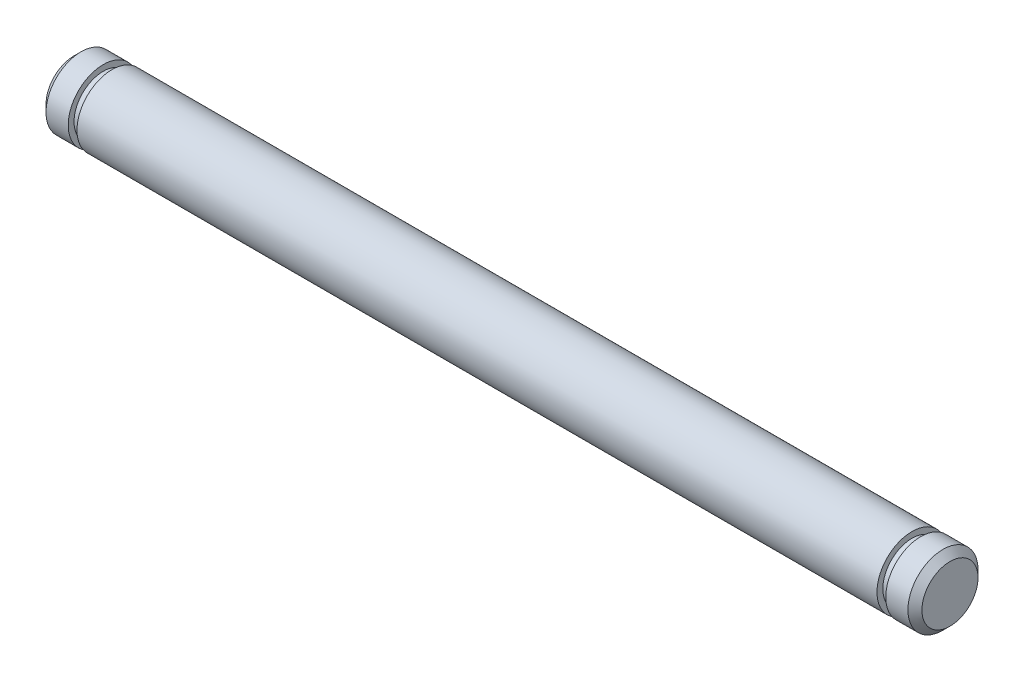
ISO-10303-21;
HEADER;
FILE_DESCRIPTION(('STEP AP214'),'2;1');
FILE_NAME('part.step','',(''),(''),'','','');
FILE_SCHEMA(('AUTOMOTIVE_DESIGN { 1 0 10303 214 1 1 1 1 }'));
ENDSEC;
DATA;
#1=APPLICATION_CONTEXT('core data for automotive mechanical design processes');
#2=APPLICATION_PROTOCOL_DEFINITION('international standard','automotive_design',2000,#1);
#3=PRODUCT_CONTEXT('',#1,'mechanical');
#4=PRODUCT('Part','Part','',(#3));
#5=PRODUCT_RELATED_PRODUCT_CATEGORY('part','',(#4));
#6=PRODUCT_DEFINITION_FORMATION('','',#4);
#7=PRODUCT_DEFINITION_CONTEXT('part definition',#1,'design');
#8=PRODUCT_DEFINITION('design','',#6,#7);
#9=PRODUCT_DEFINITION_SHAPE('','',#8);
#10=(LENGTH_UNIT() NAMED_UNIT(*) SI_UNIT(.MILLI.,.METRE.));
#11=(NAMED_UNIT(*) PLANE_ANGLE_UNIT() SI_UNIT($,.RADIAN.));
#12=(NAMED_UNIT(*) SI_UNIT($,.STERADIAN.) SOLID_ANGLE_UNIT());
#13=UNCERTAINTY_MEASURE_WITH_UNIT(LENGTH_MEASURE(1.E-05),#10,'distance_accuracy_value','');
#14=(GEOMETRIC_REPRESENTATION_CONTEXT(3) GLOBAL_UNCERTAINTY_ASSIGNED_CONTEXT((#13)) GLOBAL_UNIT_ASSIGNED_CONTEXT((#10,
#11,#12)) REPRESENTATION_CONTEXT('',''));
#15=CARTESIAN_POINT('',(0.,0.,0.));
#16=DIRECTION('',(0.,0.,1.));
#17=DIRECTION('',(1.,0.,0.));
#18=AXIS2_PLACEMENT_3D('',#15,#16,#17);
#19=CARTESIAN_POINT('',(37.5,0.,0.));
#20=DIRECTION('',(1.,0.,0.));
#21=DIRECTION('',(0.,0.,-1.));
#22=AXIS2_PLACEMENT_3D('',#19,#20,#21);
#23=PLANE('',#22);
#24=CARTESIAN_POINT('',(37.5,0.,0.));
#25=DIRECTION('',(1.,0.,0.));
#26=DIRECTION('',(0.,0.,-1.));
#27=AXIS2_PLACEMENT_3D('',#24,#25,#26);
#28=CIRCLE('',#27,2.39993235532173);
#29=CARTESIAN_POINT('',(37.5,0.,-2.39993235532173));
#30=VERTEX_POINT('',#29);
#31=EDGE_CURVE('E18',#30,#30,#28,.F.);
#32=ORIENTED_EDGE('',*,*,#31,.F.);
#33=EDGE_LOOP('',(#32));
#34=FACE_BOUND('',#33,.T.);
#35=ADVANCED_FACE('F14',(#34),#23,.T.);
#36=CARTESIAN_POINT('',(-37.5,0.,0.));
#37=DIRECTION('',(1.,0.,0.));
#38=DIRECTION('',(0.,0.,-1.));
#39=AXIS2_PLACEMENT_3D('',#36,#37,#38);
#40=PLANE('',#39);
#41=CARTESIAN_POINT('',(-37.5,0.,0.));
#42=DIRECTION('',(1.,0.,0.));
#43=DIRECTION('',(0.,0.,-1.));
#44=AXIS2_PLACEMENT_3D('',#41,#42,#43);
#45=CIRCLE('',#44,2.39993235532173);
#46=CARTESIAN_POINT('',(-37.5,0.,-2.39993235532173));
#47=VERTEX_POINT('',#46);
#48=EDGE_CURVE('E52',#47,#47,#45,.T.);
#49=ORIENTED_EDGE('',*,*,#48,.F.);
#50=EDGE_LOOP('',(#49));
#51=FACE_BOUND('',#50,.T.);
#52=ADVANCED_FACE('F62',(#51),#40,.F.);
#53=CARTESIAN_POINT('',(36.8999517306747,0.,0.));
#54=DIRECTION('',(-1.,0.,0.));
#55=DIRECTION('',(0.,0.,1.));
#56=AXIS2_PLACEMENT_3D('',#53,#54,#55);
#57=CONICAL_SURFACE('',#56,2.99996371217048,0.785384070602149);
#58=CARTESIAN_POINT('',(36.8999154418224,0.,0.));
#59=DIRECTION('',(-1.,0.,0.));
#60=DIRECTION('',(0.,0.,1.));
#61=AXIS2_PLACEMENT_3D('',#58,#59,#60);
#62=CIRCLE('',#61,3.);
#63=CARTESIAN_POINT('',(36.8999154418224,0.,3.));
#64=VERTEX_POINT('',#63);
#65=EDGE_CURVE('E50',#64,#64,#62,.T.);
#66=ORIENTED_EDGE('',*,*,#65,.F.);
#67=EDGE_LOOP('',(#66));
#68=FACE_BOUND('',#67,.T.);
#69=ORIENTED_EDGE('',*,*,#31,.T.);
#70=EDGE_LOOP('',(#69));
#71=FACE_BOUND('',#70,.T.);
#72=ADVANCED_FACE('F59',(#68,#71),#57,.T.);
#73=CARTESIAN_POINT('',(-36.8999517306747,0.,0.));
#74=DIRECTION('',(1.,0.,0.));
#75=DIRECTION('',(0.,0.,-1.));
#76=AXIS2_PLACEMENT_3D('',#73,#74,#75);
#77=CONICAL_SURFACE('',#76,2.99996371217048,0.785384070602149);
#78=CARTESIAN_POINT('',(-36.8999154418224,0.,0.));
#79=DIRECTION('',(1.,0.,0.));
#80=DIRECTION('',(0.,0.,-1.));
#81=AXIS2_PLACEMENT_3D('',#78,#79,#80);
#82=CIRCLE('',#81,3.);
#83=CARTESIAN_POINT('',(-36.8999154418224,0.,-3.));
#84=VERTEX_POINT('',#83);
#85=EDGE_CURVE('E47',#84,#84,#82,.T.);
#86=ORIENTED_EDGE('',*,*,#85,.F.);
#87=EDGE_LOOP('',(#86));
#88=FACE_BOUND('',#87,.T.);
#89=ORIENTED_EDGE('',*,*,#48,.T.);
#90=EDGE_LOOP('',(#89));
#91=FACE_BOUND('',#90,.T.);
#92=ADVANCED_FACE('F109',(#88,#91),#77,.T.);
#93=CARTESIAN_POINT('',(-37.5,0.,0.));
#94=DIRECTION('',(1.,0.,0.));
#95=DIRECTION('',(0.,0.,-1.));
#96=AXIS2_PLACEMENT_3D('',#93,#94,#95);
#97=CYLINDRICAL_SURFACE('',#96,3.);
#98=ORIENTED_EDGE('',*,*,#65,.T.);
#99=EDGE_LOOP('',(#98));
#100=FACE_BOUND('',#99,.T.);
#101=CARTESIAN_POINT('',(35.,0.,0.));
#102=DIRECTION('',(1.,0.,0.));
#103=DIRECTION('',(0.,0.,-1.));
#104=AXIS2_PLACEMENT_3D('',#101,#102,#103);
#105=CIRCLE('',#104,3.);
#106=CARTESIAN_POINT('',(35.,0.,-3.));
#107=VERTEX_POINT('',#106);
#108=EDGE_CURVE('E44',#107,#107,#105,.T.);
#109=ORIENTED_EDGE('',*,*,#108,.T.);
#110=EDGE_LOOP('',(#109));
#111=FACE_BOUND('',#110,.T.);
#112=ADVANCED_FACE('F105',(#100,#111),#97,.T.);
#113=CARTESIAN_POINT('',(-37.5,0.,0.));
#114=DIRECTION('',(1.,0.,0.));
#115=DIRECTION('',(0.,0.,-1.));
#116=AXIS2_PLACEMENT_3D('',#113,#114,#115);
#117=CYLINDRICAL_SURFACE('',#116,3.);
#118=ORIENTED_EDGE('',*,*,#85,.T.);
#119=EDGE_LOOP('',(#118));
#120=FACE_BOUND('',#119,.T.);
#121=CARTESIAN_POINT('',(-35.,0.,0.));
#122=DIRECTION('',(1.,0.,0.));
#123=DIRECTION('',(0.,0.,-1.));
#124=AXIS2_PLACEMENT_3D('',#121,#122,#123);
#125=CIRCLE('',#124,3.);
#126=CARTESIAN_POINT('',(-35.,0.,-3.));
#127=VERTEX_POINT('',#126);
#128=EDGE_CURVE('E41',#127,#127,#125,.T.);
#129=ORIENTED_EDGE('',*,*,#128,.F.);
#130=EDGE_LOOP('',(#129));
#131=FACE_BOUND('',#130,.T.);
#132=ADVANCED_FACE('F101',(#120,#131),#117,.T.);
#133=CARTESIAN_POINT('',(35.,0.,0.));
#134=DIRECTION('',(1.,0.,0.));
#135=DIRECTION('',(0.,0.,-1.));
#136=AXIS2_PLACEMENT_3D('',#133,#134,#135);
#137=PLANE('',#136);
#138=CARTESIAN_POINT('',(35.,0.,0.));
#139=DIRECTION('',(1.,0.,0.));
#140=DIRECTION('',(0.,0.,-1.));
#141=AXIS2_PLACEMENT_3D('',#138,#139,#140);
#142=CIRCLE('',#141,2.5);
#143=CARTESIAN_POINT('',(35.,0.,-2.5));
#144=VERTEX_POINT('',#143);
#145=EDGE_CURVE('E38',#144,#144,#142,.F.);
#146=ORIENTED_EDGE('',*,*,#145,.F.);
#147=EDGE_LOOP('',(#146));
#148=FACE_BOUND('',#147,.T.);
#149=ORIENTED_EDGE('',*,*,#108,.F.);
#150=EDGE_LOOP('',(#149));
#151=FACE_BOUND('',#150,.T.);
#152=ADVANCED_FACE('F97',(#148,#151),#137,.F.);
#153=CARTESIAN_POINT('',(-35.,0.,0.));
#154=DIRECTION('',(1.,0.,0.));
#155=DIRECTION('',(0.,0.,-1.));
#156=AXIS2_PLACEMENT_3D('',#153,#154,#155);
#157=PLANE('',#156);
#158=CARTESIAN_POINT('',(-35.,0.,0.));
#159=DIRECTION('',(1.,0.,0.));
#160=DIRECTION('',(0.,0.,-1.));
#161=AXIS2_PLACEMENT_3D('',#158,#159,#160);
#162=CIRCLE('',#161,2.5);
#163=CARTESIAN_POINT('',(-35.,0.,-2.5));
#164=VERTEX_POINT('',#163);
#165=EDGE_CURVE('E35',#164,#164,#162,.T.);
#166=ORIENTED_EDGE('',*,*,#165,.F.);
#167=EDGE_LOOP('',(#166));
#168=FACE_BOUND('',#167,.T.);
#169=ORIENTED_EDGE('',*,*,#128,.T.);
#170=EDGE_LOOP('',(#169));
#171=FACE_BOUND('',#170,.T.);
#172=ADVANCED_FACE('F93',(#168,#171),#157,.T.);
#173=CARTESIAN_POINT('',(35.,0.,0.));
#174=DIRECTION('',(1.,0.,0.));
#175=DIRECTION('',(0.,0.,-1.));
#176=AXIS2_PLACEMENT_3D('',#173,#174,#175);
#177=CYLINDRICAL_SURFACE('',#176,2.5);
#178=CARTESIAN_POINT('',(34.25,0.,0.));
#179=DIRECTION('',(1.,0.,0.));
#180=DIRECTION('',(0.,0.,-1.));
#181=AXIS2_PLACEMENT_3D('',#178,#179,#180);
#182=CIRCLE('',#181,2.5);
#183=CARTESIAN_POINT('',(34.25,0.,-2.5));
#184=VERTEX_POINT('',#183);
#185=EDGE_CURVE('E32',#184,#184,#182,.F.);
#186=ORIENTED_EDGE('',*,*,#185,.F.);
#187=EDGE_LOOP('',(#186));
#188=FACE_BOUND('',#187,.T.);
#189=ORIENTED_EDGE('',*,*,#145,.T.);
#190=EDGE_LOOP('',(#189));
#191=FACE_BOUND('',#190,.T.);
#192=ADVANCED_FACE('F87',(#188,#191),#177,.T.);
#193=CARTESIAN_POINT('',(-35.,0.,0.));
#194=DIRECTION('',(1.,0.,0.));
#195=DIRECTION('',(0.,0.,-1.));
#196=AXIS2_PLACEMENT_3D('',#193,#194,#195);
#197=CYLINDRICAL_SURFACE('',#196,2.5);
#198=CARTESIAN_POINT('',(-34.25,0.,0.));
#199=DIRECTION('',(1.,0.,0.));
#200=DIRECTION('',(0.,0.,-1.));
#201=AXIS2_PLACEMENT_3D('',#198,#199,#200);
#202=CIRCLE('',#201,2.5);
#203=CARTESIAN_POINT('',(-34.25,0.,-2.5));
#204=VERTEX_POINT('',#203);
#205=EDGE_CURVE('E27',#204,#204,#202,.F.);
#206=ORIENTED_EDGE('',*,*,#205,.T.);
#207=EDGE_LOOP('',(#206));
#208=FACE_BOUND('',#207,.T.);
#209=ORIENTED_EDGE('',*,*,#165,.T.);
#210=EDGE_LOOP('',(#209));
#211=FACE_BOUND('',#210,.T.);
#212=ADVANCED_FACE('F81',(#208,#211),#197,.T.);
#213=CARTESIAN_POINT('',(34.25,0.,0.));
#214=DIRECTION('',(1.,0.,0.));
#215=DIRECTION('',(0.,0.,-1.));
#216=AXIS2_PLACEMENT_3D('',#213,#214,#215);
#217=PLANE('',#216);
#218=ORIENTED_EDGE('',*,*,#185,.T.);
#219=EDGE_LOOP('',(#218));
#220=FACE_BOUND('',#219,.T.);
#221=CARTESIAN_POINT('',(34.25,0.,0.));
#222=DIRECTION('',(1.,0.,0.));
#223=DIRECTION('',(0.,0.,-1.));
#224=AXIS2_PLACEMENT_3D('',#221,#222,#223);
#225=CIRCLE('',#224,3.);
#226=CARTESIAN_POINT('',(34.25,0.,-3.));
#227=VERTEX_POINT('',#226);
#228=EDGE_CURVE('E22',#227,#227,#225,.F.);
#229=ORIENTED_EDGE('',*,*,#228,.F.);
#230=EDGE_LOOP('',(#229));
#231=FACE_BOUND('',#230,.T.);
#232=ADVANCED_FACE('F76',(#220,#231),#217,.T.);
#233=CARTESIAN_POINT('',(-34.25,0.,0.));
#234=DIRECTION('',(1.,0.,0.));
#235=DIRECTION('',(0.,0.,-1.));
#236=AXIS2_PLACEMENT_3D('',#233,#234,#235);
#237=PLANE('',#236);
#238=ORIENTED_EDGE('',*,*,#205,.F.);
#239=EDGE_LOOP('',(#238));
#240=FACE_BOUND('',#239,.T.);
#241=CARTESIAN_POINT('',(-34.25,0.,0.));
#242=DIRECTION('',(1.,0.,0.));
#243=DIRECTION('',(0.,0.,-1.));
#244=AXIS2_PLACEMENT_3D('',#241,#242,#243);
#245=CIRCLE('',#244,3.);
#246=CARTESIAN_POINT('',(-34.25,0.,-3.));
#247=VERTEX_POINT('',#246);
#248=EDGE_CURVE('E10',#247,#247,#245,.T.);
#249=ORIENTED_EDGE('',*,*,#248,.F.);
#250=EDGE_LOOP('',(#249));
#251=FACE_BOUND('',#250,.T.);
#252=ADVANCED_FACE('F71',(#240,#251),#237,.F.);
#253=CARTESIAN_POINT('',(-37.5,0.,0.));
#254=DIRECTION('',(1.,0.,0.));
#255=DIRECTION('',(0.,0.,-1.));
#256=AXIS2_PLACEMENT_3D('',#253,#254,#255);
#257=CYLINDRICAL_SURFACE('',#256,3.);
#258=ORIENTED_EDGE('',*,*,#228,.T.);
#259=EDGE_LOOP('',(#258));
#260=FACE_BOUND('',#259,.T.);
#261=ORIENTED_EDGE('',*,*,#248,.T.);
#262=EDGE_LOOP('',(#261));
#263=FACE_BOUND('',#262,.T.);
#264=ADVANCED_FACE('F16',(#260,#263),#257,.T.);
#265=CLOSED_SHELL('',(#35,#52,#72,#92,#112,#132,#152,#172,#192,#212,#232,#252,#264));
#266=MANIFOLD_SOLID_BREP('B1',#265);
#267=ADVANCED_BREP_SHAPE_REPRESENTATION('',(#18,#266),#14);
#268=SHAPE_DEFINITION_REPRESENTATION(#9,#267);
ENDSEC;
END-ISO-10303-21;
